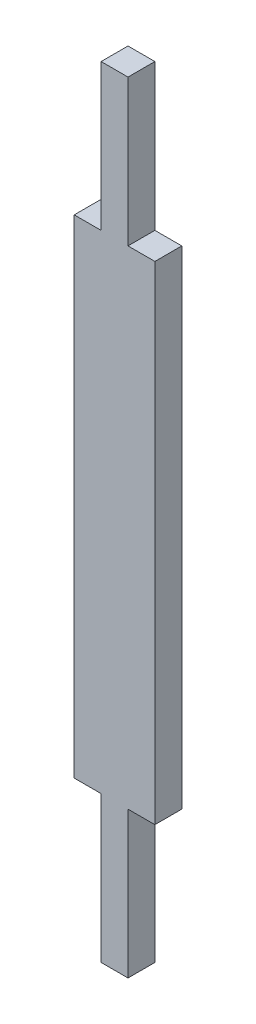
ISO-10303-21;
HEADER;
FILE_DESCRIPTION(('STEP AP214'),'2;1');
FILE_NAME('part.step','',(''),(''),'','','');
FILE_SCHEMA(('AUTOMOTIVE_DESIGN { 1 0 10303 214 1 1 1 1 }'));
ENDSEC;
DATA;
#1=APPLICATION_CONTEXT('core data for automotive mechanical design processes');
#2=APPLICATION_PROTOCOL_DEFINITION('international standard','automotive_design',2000,#1);
#3=PRODUCT_CONTEXT('',#1,'mechanical');
#4=PRODUCT('Part','Part','',(#3));
#5=PRODUCT_RELATED_PRODUCT_CATEGORY('part','',(#4));
#6=PRODUCT_DEFINITION_FORMATION('','',#4);
#7=PRODUCT_DEFINITION_CONTEXT('part definition',#1,'design');
#8=PRODUCT_DEFINITION('design','',#6,#7);
#9=PRODUCT_DEFINITION_SHAPE('','',#8);
#10=(LENGTH_UNIT() NAMED_UNIT(*) SI_UNIT(.MILLI.,.METRE.));
#11=(NAMED_UNIT(*) PLANE_ANGLE_UNIT() SI_UNIT($,.RADIAN.));
#12=(NAMED_UNIT(*) SI_UNIT($,.STERADIAN.) SOLID_ANGLE_UNIT());
#13=UNCERTAINTY_MEASURE_WITH_UNIT(LENGTH_MEASURE(1.E-05),#10,'distance_accuracy_value','');
#14=(GEOMETRIC_REPRESENTATION_CONTEXT(3) GLOBAL_UNCERTAINTY_ASSIGNED_CONTEXT((#13)) GLOBAL_UNIT_ASSIGNED_CONTEXT((#10,
#11,#12)) REPRESENTATION_CONTEXT('',''));
#15=CARTESIAN_POINT('',(0.,0.,0.));
#16=DIRECTION('',(0.,0.,1.));
#17=DIRECTION('',(1.,0.,0.));
#18=AXIS2_PLACEMENT_3D('',#15,#16,#17);
#19=CARTESIAN_POINT('',(1.524,-22.084125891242,1.524));
#20=DIRECTION('',(1.,0.,0.));
#21=DIRECTION('',(0.,0.,-1.));
#22=AXIS2_PLACEMENT_3D('',#19,#20,#21);
#23=PLANE('',#22);
#24=DIRECTION('',(0.,-1.,0.));
#25=VECTOR('',#24,1.);
#26=CARTESIAN_POINT('',(1.524,-22.084125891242,0.));
#27=LINE('',#26,#25);
#28=CARTESIAN_POINT('',(1.524,-22.084125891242,0.));
#29=VERTEX_POINT('',#28);
#30=CARTESIAN_POINT('',(1.524,-30.3714865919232,0.));
#31=VERTEX_POINT('',#30);
#32=EDGE_CURVE('E154',#29,#31,#27,.T.);
#33=ORIENTED_EDGE('',*,*,#32,.T.);
#34=DIRECTION('',(0.,0.,-1.));
#35=VECTOR('',#34,1.);
#36=CARTESIAN_POINT('',(1.524,-30.3714865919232,1.524));
#37=LINE('',#36,#35);
#38=CARTESIAN_POINT('',(1.524,-30.3714865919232,1.524));
#39=VERTEX_POINT('',#38);
#40=EDGE_CURVE('E11',#39,#31,#37,.T.);
#41=ORIENTED_EDGE('',*,*,#40,.F.);
#42=DIRECTION('',(0.,-1.,0.));
#43=VECTOR('',#42,1.);
#44=CARTESIAN_POINT('',(1.524,-22.084125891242,1.524));
#45=LINE('',#44,#43);
#46=CARTESIAN_POINT('',(1.524,-22.084125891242,1.524));
#47=VERTEX_POINT('',#46);
#48=EDGE_CURVE('E176',#47,#39,#45,.T.);
#49=ORIENTED_EDGE('',*,*,#48,.F.);
#50=DIRECTION('',(0.,0.,-1.));
#51=VECTOR('',#50,1.);
#52=CARTESIAN_POINT('',(1.524,-22.084125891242,1.524));
#53=LINE('',#52,#51);
#54=EDGE_CURVE('E150',#47,#29,#53,.T.);
#55=ORIENTED_EDGE('',*,*,#54,.T.);
#56=EDGE_LOOP('',(#33,#41,#49,#55));
#57=FACE_BOUND('',#56,.T.);
#58=ADVANCED_FACE('F34',(#57),#23,.F.);
#59=CARTESIAN_POINT('',(1.524,-30.3714865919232,1.524));
#60=DIRECTION('',(0.,1.,0.));
#61=DIRECTION('',(0.,0.,1.));
#62=AXIS2_PLACEMENT_3D('',#59,#60,#61);
#63=PLANE('',#62);
#64=DIRECTION('',(1.,0.,0.));
#65=VECTOR('',#64,1.);
#66=CARTESIAN_POINT('',(1.524,-30.3714865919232,0.));
#67=LINE('',#66,#65);
#68=CARTESIAN_POINT('',(3.048,-30.3714865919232,0.));
#69=VERTEX_POINT('',#68);
#70=EDGE_CURVE('E157',#31,#69,#67,.T.);
#71=ORIENTED_EDGE('',*,*,#70,.T.);
#72=DIRECTION('',(0.,0.,-1.));
#73=VECTOR('',#72,1.);
#74=CARTESIAN_POINT('',(3.048,-30.3714865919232,1.524));
#75=LINE('',#74,#73);
#76=CARTESIAN_POINT('',(3.048,-30.3714865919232,1.524));
#77=VERTEX_POINT('',#76);
#78=EDGE_CURVE('E42',#77,#69,#75,.T.);
#79=ORIENTED_EDGE('',*,*,#78,.F.);
#80=DIRECTION('',(1.,0.,0.));
#81=VECTOR('',#80,1.);
#82=CARTESIAN_POINT('',(1.524,-30.3714865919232,1.524));
#83=LINE('',#82,#81);
#84=EDGE_CURVE('E105',#39,#77,#83,.T.);
#85=ORIENTED_EDGE('',*,*,#84,.F.);
#86=ORIENTED_EDGE('',*,*,#40,.T.);
#87=EDGE_LOOP('',(#71,#79,#85,#86));
#88=FACE_BOUND('',#87,.T.);
#89=ADVANCED_FACE('F254',(#88),#63,.F.);
#90=CARTESIAN_POINT('',(3.048,-22.084125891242,1.524));
#91=DIRECTION('',(-1.,0.,0.));
#92=DIRECTION('',(0.,-1.,0.));
#93=AXIS2_PLACEMENT_3D('',#90,#91,#92);
#94=PLANE('',#93);
#95=DIRECTION('',(0.,1.,0.));
#96=VECTOR('',#95,1.);
#97=CARTESIAN_POINT('',(3.048,-22.084125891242,0.));
#98=LINE('',#97,#96);
#99=CARTESIAN_POINT('',(3.048,-22.084125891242,0.));
#100=VERTEX_POINT('',#99);
#101=EDGE_CURVE('E159',#69,#100,#98,.T.);
#102=ORIENTED_EDGE('',*,*,#101,.T.);
#103=DIRECTION('',(0.,0.,-1.));
#104=VECTOR('',#103,1.);
#105=CARTESIAN_POINT('',(3.048,-22.084125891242,1.524));
#106=LINE('',#105,#104);
#107=CARTESIAN_POINT('',(3.048,-22.084125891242,1.524));
#108=VERTEX_POINT('',#107);
#109=EDGE_CURVE('E195',#108,#100,#106,.T.);
#110=ORIENTED_EDGE('',*,*,#109,.F.);
#111=DIRECTION('',(0.,1.,0.));
#112=VECTOR('',#111,1.);
#113=CARTESIAN_POINT('',(3.048,-22.084125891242,1.524));
#114=LINE('',#113,#112);
#115=EDGE_CURVE('E203',#77,#108,#114,.T.);
#116=ORIENTED_EDGE('',*,*,#115,.F.);
#117=ORIENTED_EDGE('',*,*,#78,.T.);
#118=EDGE_LOOP('',(#102,#110,#116,#117));
#119=FACE_BOUND('',#118,.T.);
#120=ADVANCED_FACE('F201',(#119),#94,.F.);
#121=CARTESIAN_POINT('',(3.048,-22.084125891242,1.524));
#122=DIRECTION('',(0.,1.,0.));
#123=DIRECTION('',(-1.,0.,0.));
#124=AXIS2_PLACEMENT_3D('',#121,#122,#123);
#125=PLANE('',#124);
#126=DIRECTION('',(1.,0.,0.));
#127=VECTOR('',#126,1.);
#128=CARTESIAN_POINT('',(3.048,-22.084125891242,0.));
#129=LINE('',#128,#127);
#130=CARTESIAN_POINT('',(4.572,-22.084125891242,0.));
#131=VERTEX_POINT('',#130);
#132=EDGE_CURVE('E161',#100,#131,#129,.T.);
#133=ORIENTED_EDGE('',*,*,#132,.T.);
#134=DIRECTION('',(0.,0.,-1.));
#135=VECTOR('',#134,1.);
#136=CARTESIAN_POINT('',(4.572,-22.084125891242,1.524));
#137=LINE('',#136,#135);
#138=CARTESIAN_POINT('',(4.572,-22.084125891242,1.524));
#139=VERTEX_POINT('',#138);
#140=EDGE_CURVE('E192',#139,#131,#137,.T.);
#141=ORIENTED_EDGE('',*,*,#140,.F.);
#142=DIRECTION('',(1.,0.,0.));
#143=VECTOR('',#142,1.);
#144=CARTESIAN_POINT('',(3.048,-22.084125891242,1.524));
#145=LINE('',#144,#143);
#146=EDGE_CURVE('E221',#108,#139,#145,.T.);
#147=ORIENTED_EDGE('',*,*,#146,.F.);
#148=ORIENTED_EDGE('',*,*,#109,.T.);
#149=EDGE_LOOP('',(#133,#141,#147,#148));
#150=FACE_BOUND('',#149,.T.);
#151=ADVANCED_FACE('F212',(#150),#125,.F.);
#152=CARTESIAN_POINT('',(4.572,-22.084125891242,1.524));
#153=DIRECTION('',(-1.,0.,0.));
#154=DIRECTION('',(0.,0.,1.));
#155=AXIS2_PLACEMENT_3D('',#152,#153,#154);
#156=PLANE('',#155);
#157=DIRECTION('',(0.,1.,0.));
#158=VECTOR('',#157,1.);
#159=CARTESIAN_POINT('',(4.572,-22.084125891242,0.));
#160=LINE('',#159,#158);
#161=CARTESIAN_POINT('',(4.572,5.56100192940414,0.));
#162=VERTEX_POINT('',#161);
#163=EDGE_CURVE('E163',#131,#162,#160,.T.);
#164=ORIENTED_EDGE('',*,*,#163,.T.);
#165=DIRECTION('',(0.,0.,-1.));
#166=VECTOR('',#165,1.);
#167=CARTESIAN_POINT('',(4.572,5.56100192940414,1.524));
#168=LINE('',#167,#166);
#169=CARTESIAN_POINT('',(4.572,5.56100192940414,1.524));
#170=VERTEX_POINT('',#169);
#171=EDGE_CURVE('E189',#170,#162,#168,.T.);
#172=ORIENTED_EDGE('',*,*,#171,.F.);
#173=DIRECTION('',(0.,1.,0.));
#174=VECTOR('',#173,1.);
#175=CARTESIAN_POINT('',(4.572,-22.084125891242,1.524));
#176=LINE('',#175,#174);
#177=EDGE_CURVE('E218',#139,#170,#176,.T.);
#178=ORIENTED_EDGE('',*,*,#177,.F.);
#179=ORIENTED_EDGE('',*,*,#140,.T.);
#180=EDGE_LOOP('',(#164,#172,#178,#179));
#181=FACE_BOUND('',#180,.T.);
#182=ADVANCED_FACE('F216',(#181),#156,.F.);
#183=CARTESIAN_POINT('',(4.572,5.56100192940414,1.524));
#184=DIRECTION('',(0.,-1.,0.));
#185=DIRECTION('',(1.,0.,0.));
#186=AXIS2_PLACEMENT_3D('',#183,#184,#185);
#187=PLANE('',#186);
#188=DIRECTION('',(-1.,0.,0.));
#189=VECTOR('',#188,1.);
#190=CARTESIAN_POINT('',(4.572,5.56100192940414,0.));
#191=LINE('',#190,#189);
#192=CARTESIAN_POINT('',(3.048,5.56100192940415,0.));
#193=VERTEX_POINT('',#192);
#194=EDGE_CURVE('E165',#162,#193,#191,.T.);
#195=ORIENTED_EDGE('',*,*,#194,.T.);
#196=DIRECTION('',(0.,0.,-1.));
#197=VECTOR('',#196,1.);
#198=CARTESIAN_POINT('',(3.048,5.56100192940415,1.524));
#199=LINE('',#198,#197);
#200=CARTESIAN_POINT('',(3.048,5.56100192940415,1.524));
#201=VERTEX_POINT('',#200);
#202=EDGE_CURVE('E186',#201,#193,#199,.T.);
#203=ORIENTED_EDGE('',*,*,#202,.F.);
#204=DIRECTION('',(-1.,0.,0.));
#205=VECTOR('',#204,1.);
#206=CARTESIAN_POINT('',(4.572,5.56100192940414,1.524));
#207=LINE('',#206,#205);
#208=EDGE_CURVE('E220',#170,#201,#207,.T.);
#209=ORIENTED_EDGE('',*,*,#208,.F.);
#210=ORIENTED_EDGE('',*,*,#171,.T.);
#211=EDGE_LOOP('',(#195,#203,#209,#210));
#212=FACE_BOUND('',#211,.T.);
#213=ADVANCED_FACE('F267',(#212),#187,.F.);
#214=CARTESIAN_POINT('',(3.048,5.56100192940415,1.524));
#215=DIRECTION('',(-1.,0.,0.));
#216=DIRECTION('',(0.,-1.,0.));
#217=AXIS2_PLACEMENT_3D('',#214,#215,#216);
#218=PLANE('',#217);
#219=DIRECTION('',(0.,1.,0.));
#220=VECTOR('',#219,1.);
#221=CARTESIAN_POINT('',(3.048,5.56100192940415,0.));
#222=LINE('',#221,#220);
#223=CARTESIAN_POINT('',(3.048,13.8483626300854,0.));
#224=VERTEX_POINT('',#223);
#225=EDGE_CURVE('E167',#193,#224,#222,.T.);
#226=ORIENTED_EDGE('',*,*,#225,.T.);
#227=DIRECTION('',(0.,0.,-1.));
#228=VECTOR('',#227,1.);
#229=CARTESIAN_POINT('',(3.048,13.8483626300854,1.524));
#230=LINE('',#229,#228);
#231=CARTESIAN_POINT('',(3.048,13.8483626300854,1.524));
#232=VERTEX_POINT('',#231);
#233=EDGE_CURVE('E183',#232,#224,#230,.T.);
#234=ORIENTED_EDGE('',*,*,#233,.F.);
#235=DIRECTION('',(0.,1.,0.));
#236=VECTOR('',#235,1.);
#237=CARTESIAN_POINT('',(3.048,5.56100192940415,1.524));
#238=LINE('',#237,#236);
#239=EDGE_CURVE('E223',#201,#232,#238,.T.);
#240=ORIENTED_EDGE('',*,*,#239,.F.);
#241=ORIENTED_EDGE('',*,*,#202,.T.);
#242=EDGE_LOOP('',(#226,#234,#240,#241));
#243=FACE_BOUND('',#242,.T.);
#244=ADVANCED_FACE('F270',(#243),#218,.F.);
#245=CARTESIAN_POINT('',(1.524,13.8483626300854,1.524));
#246=DIRECTION('',(0.,-1.,0.));
#247=DIRECTION('',(0.,0.,-1.));
#248=AXIS2_PLACEMENT_3D('',#245,#246,#247);
#249=PLANE('',#248);
#250=DIRECTION('',(-1.,0.,0.));
#251=VECTOR('',#250,1.);
#252=CARTESIAN_POINT('',(1.524,13.8483626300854,0.));
#253=LINE('',#252,#251);
#254=CARTESIAN_POINT('',(1.524,13.8483626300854,0.));
#255=VERTEX_POINT('',#254);
#256=EDGE_CURVE('E169',#224,#255,#253,.T.);
#257=ORIENTED_EDGE('',*,*,#256,.T.);
#258=DIRECTION('',(0.,0.,-1.));
#259=VECTOR('',#258,1.);
#260=CARTESIAN_POINT('',(1.524,13.8483626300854,1.524));
#261=LINE('',#260,#259);
#262=CARTESIAN_POINT('',(1.524,13.8483626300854,1.524));
#263=VERTEX_POINT('',#262);
#264=EDGE_CURVE('E180',#263,#255,#261,.T.);
#265=ORIENTED_EDGE('',*,*,#264,.F.);
#266=DIRECTION('',(-1.,0.,0.));
#267=VECTOR('',#266,1.);
#268=CARTESIAN_POINT('',(1.524,13.8483626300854,1.524));
#269=LINE('',#268,#267);
#270=EDGE_CURVE('E229',#232,#263,#269,.T.);
#271=ORIENTED_EDGE('',*,*,#270,.F.);
#272=ORIENTED_EDGE('',*,*,#233,.T.);
#273=EDGE_LOOP('',(#257,#265,#271,#272));
#274=FACE_BOUND('',#273,.T.);
#275=ADVANCED_FACE('F235',(#274),#249,.F.);
#276=CARTESIAN_POINT('',(1.524,5.56100192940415,1.524));
#277=DIRECTION('',(1.,0.,0.));
#278=DIRECTION('',(0.,0.,-1.));
#279=AXIS2_PLACEMENT_3D('',#276,#277,#278);
#280=PLANE('',#279);
#281=DIRECTION('',(0.,-1.,0.));
#282=VECTOR('',#281,1.);
#283=CARTESIAN_POINT('',(1.524,5.56100192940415,0.));
#284=LINE('',#283,#282);
#285=CARTESIAN_POINT('',(1.524,5.56100192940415,0.));
#286=VERTEX_POINT('',#285);
#287=EDGE_CURVE('E171',#255,#286,#284,.T.);
#288=ORIENTED_EDGE('',*,*,#287,.T.);
#289=DIRECTION('',(0.,0.,-1.));
#290=VECTOR('',#289,1.);
#291=CARTESIAN_POINT('',(1.524,5.56100192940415,1.524));
#292=LINE('',#291,#290);
#293=CARTESIAN_POINT('',(1.524,5.56100192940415,1.524));
#294=VERTEX_POINT('',#293);
#295=EDGE_CURVE('E145',#294,#286,#292,.T.);
#296=ORIENTED_EDGE('',*,*,#295,.F.);
#297=DIRECTION('',(0.,-1.,0.));
#298=VECTOR('',#297,1.);
#299=CARTESIAN_POINT('',(1.524,5.56100192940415,1.524));
#300=LINE('',#299,#298);
#301=EDGE_CURVE('E136',#263,#294,#300,.T.);
#302=ORIENTED_EDGE('',*,*,#301,.F.);
#303=ORIENTED_EDGE('',*,*,#264,.T.);
#304=EDGE_LOOP('',(#288,#296,#302,#303));
#305=FACE_BOUND('',#304,.T.);
#306=ADVANCED_FACE('F239',(#305),#280,.F.);
#307=CARTESIAN_POINT('',(0.,5.56100192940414,1.524));
#308=DIRECTION('',(0.,-1.,0.));
#309=DIRECTION('',(1.,0.,0.));
#310=AXIS2_PLACEMENT_3D('',#307,#308,#309);
#311=PLANE('',#310);
#312=DIRECTION('',(-1.,0.,0.));
#313=VECTOR('',#312,1.);
#314=CARTESIAN_POINT('',(0.,5.56100192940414,0.));
#315=LINE('',#314,#313);
#316=CARTESIAN_POINT('',(0.,5.56100192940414,0.));
#317=VERTEX_POINT('',#316);
#318=EDGE_CURVE('E144',#286,#317,#315,.T.);
#319=ORIENTED_EDGE('',*,*,#318,.T.);
#320=DIRECTION('',(0.,0.,-1.));
#321=VECTOR('',#320,1.);
#322=CARTESIAN_POINT('',(0.,5.56100192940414,1.524));
#323=LINE('',#322,#321);
#324=CARTESIAN_POINT('',(0.,5.56100192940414,1.524));
#325=VERTEX_POINT('',#324);
#326=EDGE_CURVE('E141',#325,#317,#323,.T.);
#327=ORIENTED_EDGE('',*,*,#326,.F.);
#328=DIRECTION('',(-1.,0.,0.));
#329=VECTOR('',#328,1.);
#330=CARTESIAN_POINT('',(0.,5.56100192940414,1.524));
#331=LINE('',#330,#329);
#332=EDGE_CURVE('E130',#294,#325,#331,.T.);
#333=ORIENTED_EDGE('',*,*,#332,.F.);
#334=ORIENTED_EDGE('',*,*,#295,.T.);
#335=EDGE_LOOP('',(#319,#327,#333,#334));
#336=FACE_BOUND('',#335,.T.);
#337=ADVANCED_FACE('F142',(#336),#311,.F.);
#338=CARTESIAN_POINT('',(0.,-22.084125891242,1.524));
#339=DIRECTION('',(1.,0.,0.));
#340=DIRECTION('',(0.,0.,-1.));
#341=AXIS2_PLACEMENT_3D('',#338,#339,#340);
#342=PLANE('',#341);
#343=DIRECTION('',(0.,-1.,0.));
#344=VECTOR('',#343,1.);
#345=CARTESIAN_POINT('',(0.,-22.084125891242,0.));
#346=LINE('',#345,#344);
#347=CARTESIAN_POINT('',(0.,-22.084125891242,0.));
#348=VERTEX_POINT('',#347);
#349=EDGE_CURVE('E91',#317,#348,#346,.T.);
#350=ORIENTED_EDGE('',*,*,#349,.T.);
#351=DIRECTION('',(0.,0.,-1.));
#352=VECTOR('',#351,1.);
#353=CARTESIAN_POINT('',(0.,-22.084125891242,1.524));
#354=LINE('',#353,#352);
#355=CARTESIAN_POINT('',(0.,-22.084125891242,1.524));
#356=VERTEX_POINT('',#355);
#357=EDGE_CURVE('E146',#356,#348,#354,.T.);
#358=ORIENTED_EDGE('',*,*,#357,.F.);
#359=DIRECTION('',(0.,-1.,0.));
#360=VECTOR('',#359,1.);
#361=CARTESIAN_POINT('',(0.,-22.084125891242,1.524));
#362=LINE('',#361,#360);
#363=EDGE_CURVE('E134',#325,#356,#362,.T.);
#364=ORIENTED_EDGE('',*,*,#363,.F.);
#365=ORIENTED_EDGE('',*,*,#326,.T.);
#366=EDGE_LOOP('',(#350,#358,#364,#365));
#367=FACE_BOUND('',#366,.T.);
#368=ADVANCED_FACE('F148',(#367),#342,.F.);
#369=CARTESIAN_POINT('',(1.524,-22.084125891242,1.524));
#370=DIRECTION('',(0.,1.,0.));
#371=DIRECTION('',(-1.,0.,0.));
#372=AXIS2_PLACEMENT_3D('',#369,#370,#371);
#373=PLANE('',#372);
#374=DIRECTION('',(1.,0.,0.));
#375=VECTOR('',#374,1.);
#376=CARTESIAN_POINT('',(1.524,-22.084125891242,0.));
#377=LINE('',#376,#375);
#378=EDGE_CURVE('E97',#348,#29,#377,.T.);
#379=ORIENTED_EDGE('',*,*,#378,.T.);
#380=ORIENTED_EDGE('',*,*,#54,.F.);
#381=DIRECTION('',(1.,0.,0.));
#382=VECTOR('',#381,1.);
#383=CARTESIAN_POINT('',(1.524,-22.084125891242,1.524));
#384=LINE('',#383,#382);
#385=EDGE_CURVE('E50',#356,#47,#384,.T.);
#386=ORIENTED_EDGE('',*,*,#385,.F.);
#387=ORIENTED_EDGE('',*,*,#357,.T.);
#388=EDGE_LOOP('',(#379,#380,#386,#387));
#389=FACE_BOUND('',#388,.T.);
#390=ADVANCED_FACE('F243',(#389),#373,.F.);
#391=CARTESIAN_POINT('',(0.,0.,1.524));
#392=DIRECTION('',(0.,0.,1.));
#393=DIRECTION('',(1.,0.,0.));
#394=AXIS2_PLACEMENT_3D('',#391,#392,#393);
#395=PLANE('',#394);
#396=ORIENTED_EDGE('',*,*,#48,.T.);
#397=ORIENTED_EDGE('',*,*,#84,.T.);
#398=ORIENTED_EDGE('',*,*,#115,.T.);
#399=ORIENTED_EDGE('',*,*,#146,.T.);
#400=ORIENTED_EDGE('',*,*,#177,.T.);
#401=ORIENTED_EDGE('',*,*,#208,.T.);
#402=ORIENTED_EDGE('',*,*,#239,.T.);
#403=ORIENTED_EDGE('',*,*,#270,.T.);
#404=ORIENTED_EDGE('',*,*,#301,.T.);
#405=ORIENTED_EDGE('',*,*,#332,.T.);
#406=ORIENTED_EDGE('',*,*,#363,.T.);
#407=ORIENTED_EDGE('',*,*,#385,.T.);
#408=EDGE_LOOP('',(#396,#397,#398,#399,#400,#401,#402,#403,#404,#405,#406,#407));
#409=FACE_BOUND('',#408,.T.);
#410=ADVANCED_FACE('F132',(#409),#395,.T.);
#411=CARTESIAN_POINT('',(0.,0.,0.));
#412=DIRECTION('',(0.,0.,1.));
#413=DIRECTION('',(1.,0.,0.));
#414=AXIS2_PLACEMENT_3D('',#411,#412,#413);
#415=PLANE('',#414);
#416=ORIENTED_EDGE('',*,*,#32,.F.);
#417=ORIENTED_EDGE('',*,*,#378,.F.);
#418=ORIENTED_EDGE('',*,*,#349,.F.);
#419=ORIENTED_EDGE('',*,*,#318,.F.);
#420=ORIENTED_EDGE('',*,*,#287,.F.);
#421=ORIENTED_EDGE('',*,*,#256,.F.);
#422=ORIENTED_EDGE('',*,*,#225,.F.);
#423=ORIENTED_EDGE('',*,*,#194,.F.);
#424=ORIENTED_EDGE('',*,*,#163,.F.);
#425=ORIENTED_EDGE('',*,*,#132,.F.);
#426=ORIENTED_EDGE('',*,*,#101,.F.);
#427=ORIENTED_EDGE('',*,*,#70,.F.);
#428=EDGE_LOOP('',(#416,#417,#418,#419,#420,#421,#422,#423,#424,#425,#426,#427));
#429=FACE_BOUND('',#428,.T.);
#430=ADVANCED_FACE('F207',(#429),#415,.F.);
#431=CLOSED_SHELL('',(#58,#89,#120,#151,#182,#213,#244,#275,#306,#337,#368,#390,#410,#430));
#432=MANIFOLD_SOLID_BREP('B2',#431);
#433=ADVANCED_BREP_SHAPE_REPRESENTATION('',(#18,#432),#14);
#434=SHAPE_DEFINITION_REPRESENTATION(#9,#433);
ENDSEC;
END-ISO-10303-21;
